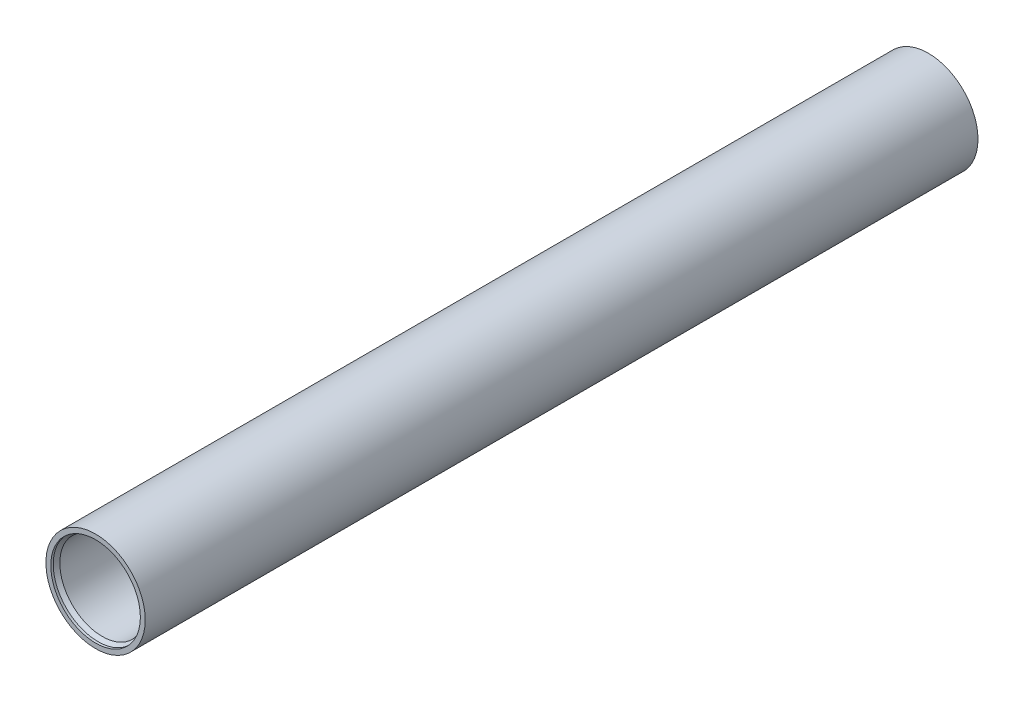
ISO-10303-21;
HEADER;
FILE_DESCRIPTION(('STEP AP214'),'2;1');
FILE_NAME('part.step','',(''),(''),'','','');
FILE_SCHEMA(('AUTOMOTIVE_DESIGN { 1 0 10303 214 1 1 1 1 }'));
ENDSEC;
DATA;
#1=APPLICATION_CONTEXT('core data for automotive mechanical design processes');
#2=APPLICATION_PROTOCOL_DEFINITION('international standard','automotive_design',2000,#1);
#3=PRODUCT_CONTEXT('',#1,'mechanical');
#4=PRODUCT('Part','Part','',(#3));
#5=PRODUCT_RELATED_PRODUCT_CATEGORY('part','',(#4));
#6=PRODUCT_DEFINITION_FORMATION('','',#4);
#7=PRODUCT_DEFINITION_CONTEXT('part definition',#1,'design');
#8=PRODUCT_DEFINITION('design','',#6,#7);
#9=PRODUCT_DEFINITION_SHAPE('','',#8);
#10=(LENGTH_UNIT() NAMED_UNIT(*) SI_UNIT(.MILLI.,.METRE.));
#11=(NAMED_UNIT(*) PLANE_ANGLE_UNIT() SI_UNIT($,.RADIAN.));
#12=(NAMED_UNIT(*) SI_UNIT($,.STERADIAN.) SOLID_ANGLE_UNIT());
#13=UNCERTAINTY_MEASURE_WITH_UNIT(LENGTH_MEASURE(1.E-05),#10,'distance_accuracy_value','');
#14=(GEOMETRIC_REPRESENTATION_CONTEXT(3) GLOBAL_UNCERTAINTY_ASSIGNED_CONTEXT((#13)) GLOBAL_UNIT_ASSIGNED_CONTEXT((#10,
#11,#12)) REPRESENTATION_CONTEXT('',''));
#15=CARTESIAN_POINT('',(0.,0.,0.));
#16=DIRECTION('',(0.,0.,1.));
#17=DIRECTION('',(1.,0.,0.));
#18=AXIS2_PLACEMENT_3D('',#15,#16,#17);
#19=CARTESIAN_POINT('',(0.,0.,260.460594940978));
#20=DIRECTION('',(0.,0.,1.));
#21=DIRECTION('',(1.,0.,0.));
#22=AXIS2_PLACEMENT_3D('',#19,#20,#21);
#23=CYLINDRICAL_SURFACE('',#22,20.6375);
#24=CARTESIAN_POINT('',(0.,0.,173.0375));
#25=DIRECTION('',(0.,0.,1.));
#26=DIRECTION('',(1.,0.,0.));
#27=AXIS2_PLACEMENT_3D('',#24,#25,#26);
#28=CIRCLE('',#27,20.6375);
#29=CARTESIAN_POINT('',(20.6375,0.,173.0375));
#30=VERTEX_POINT('',#29);
#31=EDGE_CURVE('E10',#30,#30,#28,.T.);
#32=ORIENTED_EDGE('',*,*,#31,.F.);
#33=EDGE_LOOP('',(#32));
#34=FACE_BOUND('',#33,.T.);
#35=CARTESIAN_POINT('',(0.,0.,-173.0375));
#36=DIRECTION('',(0.,0.,1.));
#37=DIRECTION('',(1.,0.,0.));
#38=AXIS2_PLACEMENT_3D('',#35,#36,#37);
#39=CIRCLE('',#38,20.6375);
#40=CARTESIAN_POINT('',(20.6375,0.,-173.0375));
#41=VERTEX_POINT('',#40);
#42=EDGE_CURVE('E93',#41,#41,#39,.T.);
#43=ORIENTED_EDGE('',*,*,#42,.T.);
#44=EDGE_LOOP('',(#43));
#45=FACE_BOUND('',#44,.T.);
#46=ADVANCED_FACE('F29',(#34,#45),#23,.T.);
#47=CARTESIAN_POINT('',(0.,20.6375,173.0375));
#48=DIRECTION('',(0.,0.,-1.));
#49=DIRECTION('',(-1.,0.,0.));
#50=AXIS2_PLACEMENT_3D('',#47,#48,#49);
#51=PLANE('',#50);
#52=CARTESIAN_POINT('',(0.,0.,173.0375));
#53=DIRECTION('',(0.,0.,1.));
#54=DIRECTION('',(1.,0.,0.));
#55=AXIS2_PLACEMENT_3D('',#52,#53,#54);
#56=CIRCLE('',#55,18.6182);
#57=CARTESIAN_POINT('',(18.6182,0.,173.0375));
#58=VERTEX_POINT('',#57);
#59=EDGE_CURVE('E35',#58,#58,#56,.T.);
#60=ORIENTED_EDGE('',*,*,#59,.F.);
#61=EDGE_LOOP('',(#60));
#62=FACE_BOUND('',#61,.T.);
#63=ORIENTED_EDGE('',*,*,#31,.T.);
#64=EDGE_LOOP('',(#63));
#65=FACE_BOUND('',#64,.T.);
#66=ADVANCED_FACE('F202',(#62,#65),#51,.F.);
#67=CARTESIAN_POINT('',(0.,0.,260.460594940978));
#68=DIRECTION('',(0.,0.,1.));
#69=DIRECTION('',(1.,0.,0.));
#70=AXIS2_PLACEMENT_3D('',#67,#68,#69);
#71=CYLINDRICAL_SURFACE('',#70,18.6182);
#72=CARTESIAN_POINT('',(0.,0.,172.0215));
#73=DIRECTION('',(0.,0.,1.));
#74=DIRECTION('',(1.,0.,0.));
#75=AXIS2_PLACEMENT_3D('',#72,#73,#74);
#76=CIRCLE('',#75,18.6182);
#77=CARTESIAN_POINT('',(18.6182,0.,172.0215));
#78=VERTEX_POINT('',#77);
#79=EDGE_CURVE('E39',#78,#78,#76,.T.);
#80=ORIENTED_EDGE('',*,*,#79,.F.);
#81=EDGE_LOOP('',(#80));
#82=FACE_BOUND('',#81,.T.);
#83=ORIENTED_EDGE('',*,*,#59,.T.);
#84=EDGE_LOOP('',(#83));
#85=FACE_BOUND('',#84,.T.);
#86=ADVANCED_FACE('F197',(#82,#85),#71,.F.);
#87=CARTESIAN_POINT('',(0.,0.,172.0215));
#88=DIRECTION('',(0.,0.,1.));
#89=DIRECTION('',(1.,0.,0.));
#90=AXIS2_PLACEMENT_3D('',#87,#88,#89);
#91=CONICAL_SURFACE('',#90,18.6182,0.523598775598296);
#92=CARTESIAN_POINT('',(0.,0.,170.283733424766));
#93=DIRECTION('',(0.,0.,1.));
#94=DIRECTION('',(1.,0.,0.));
#95=AXIS2_PLACEMENT_3D('',#92,#93,#94);
#96=CIRCLE('',#95,17.6149);
#97=CARTESIAN_POINT('',(17.6149,0.,170.283733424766));
#98=VERTEX_POINT('',#97);
#99=EDGE_CURVE('E43',#98,#98,#96,.T.);
#100=ORIENTED_EDGE('',*,*,#99,.F.);
#101=EDGE_LOOP('',(#100));
#102=FACE_BOUND('',#101,.T.);
#103=ORIENTED_EDGE('',*,*,#79,.T.);
#104=EDGE_LOOP('',(#103));
#105=FACE_BOUND('',#104,.T.);
#106=ADVANCED_FACE('F191',(#102,#105),#91,.F.);
#107=CARTESIAN_POINT('',(0.,0.,260.460594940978));
#108=DIRECTION('',(0.,0.,1.));
#109=DIRECTION('',(1.,0.,0.));
#110=AXIS2_PLACEMENT_3D('',#107,#108,#109);
#111=CYLINDRICAL_SURFACE('',#110,17.6149);
#112=CARTESIAN_POINT('',(0.,0.,142.875));
#113=DIRECTION('',(0.,0.,1.));
#114=DIRECTION('',(1.,0.,0.));
#115=AXIS2_PLACEMENT_3D('',#112,#113,#114);
#116=CIRCLE('',#115,17.6149);
#117=CARTESIAN_POINT('',(17.6149,0.,142.875));
#118=VERTEX_POINT('',#117);
#119=EDGE_CURVE('E48',#118,#118,#116,.T.);
#120=ORIENTED_EDGE('',*,*,#119,.F.);
#121=EDGE_LOOP('',(#120));
#122=FACE_BOUND('',#121,.T.);
#123=ORIENTED_EDGE('',*,*,#99,.T.);
#124=EDGE_LOOP('',(#123));
#125=FACE_BOUND('',#124,.T.);
#126=ADVANCED_FACE('F185',(#122,#125),#111,.F.);
#127=CARTESIAN_POINT('',(0.,17.6149,142.875));
#128=DIRECTION('',(0.,0.,1.));
#129=DIRECTION('',(1.,0.,0.));
#130=AXIS2_PLACEMENT_3D('',#127,#128,#129);
#131=PLANE('',#130);
#132=CARTESIAN_POINT('',(0.,0.,142.875));
#133=DIRECTION('',(0.,0.,1.));
#134=DIRECTION('',(1.,0.,0.));
#135=AXIS2_PLACEMENT_3D('',#132,#133,#134);
#136=CIRCLE('',#135,17.6276);
#137=CARTESIAN_POINT('',(17.6276,0.,142.875));
#138=VERTEX_POINT('',#137);
#139=EDGE_CURVE('E51',#138,#138,#136,.T.);
#140=ORIENTED_EDGE('',*,*,#139,.F.);
#141=EDGE_LOOP('',(#140));
#142=FACE_BOUND('',#141,.T.);
#143=ORIENTED_EDGE('',*,*,#119,.T.);
#144=EDGE_LOOP('',(#143));
#145=FACE_BOUND('',#144,.T.);
#146=ADVANCED_FACE('F179',(#142,#145),#131,.F.);
#147=CARTESIAN_POINT('',(0.,0.,260.460594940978));
#148=DIRECTION('',(0.,0.,1.));
#149=DIRECTION('',(1.,0.,0.));
#150=AXIS2_PLACEMENT_3D('',#147,#148,#149);
#151=CYLINDRICAL_SURFACE('',#150,17.6276);
#152=CARTESIAN_POINT('',(0.,0.,125.4125));
#153=DIRECTION('',(0.,0.,1.));
#154=DIRECTION('',(1.,0.,0.));
#155=AXIS2_PLACEMENT_3D('',#152,#153,#154);
#156=CIRCLE('',#155,17.6276);
#157=CARTESIAN_POINT('',(17.6276,0.,125.4125));
#158=VERTEX_POINT('',#157);
#159=EDGE_CURVE('E54',#158,#158,#156,.T.);
#160=ORIENTED_EDGE('',*,*,#159,.F.);
#161=EDGE_LOOP('',(#160));
#162=FACE_BOUND('',#161,.T.);
#163=ORIENTED_EDGE('',*,*,#139,.T.);
#164=EDGE_LOOP('',(#163));
#165=FACE_BOUND('',#164,.T.);
#166=ADVANCED_FACE('F173',(#162,#165),#151,.F.);
#167=CARTESIAN_POINT('',(0.,17.6276,125.4125));
#168=DIRECTION('',(0.,0.,-1.));
#169=DIRECTION('',(-1.,0.,0.));
#170=AXIS2_PLACEMENT_3D('',#167,#168,#169);
#171=PLANE('',#170);
#172=CARTESIAN_POINT('',(0.,0.,125.4125));
#173=DIRECTION('',(0.,0.,1.));
#174=DIRECTION('',(1.,0.,0.));
#175=AXIS2_PLACEMENT_3D('',#172,#173,#174);
#176=CIRCLE('',#175,17.4625);
#177=CARTESIAN_POINT('',(17.4625,0.,125.4125));
#178=VERTEX_POINT('',#177);
#179=EDGE_CURVE('E57',#178,#178,#176,.T.);
#180=ORIENTED_EDGE('',*,*,#179,.F.);
#181=EDGE_LOOP('',(#180));
#182=FACE_BOUND('',#181,.T.);
#183=ORIENTED_EDGE('',*,*,#159,.T.);
#184=EDGE_LOOP('',(#183));
#185=FACE_BOUND('',#184,.T.);
#186=ADVANCED_FACE('F167',(#182,#185),#171,.F.);
#187=CARTESIAN_POINT('',(0.,0.,260.460594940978));
#188=DIRECTION('',(0.,0.,1.));
#189=DIRECTION('',(1.,0.,0.));
#190=AXIS2_PLACEMENT_3D('',#187,#188,#189);
#191=CYLINDRICAL_SURFACE('',#190,17.4625);
#192=CARTESIAN_POINT('',(0.,0.,93.5355));
#193=DIRECTION('',(0.,0.,1.));
#194=DIRECTION('',(1.,0.,0.));
#195=AXIS2_PLACEMENT_3D('',#192,#193,#194);
#196=CIRCLE('',#195,17.4625);
#197=CARTESIAN_POINT('',(17.4625,0.,93.5355));
#198=VERTEX_POINT('',#197);
#199=EDGE_CURVE('E60',#198,#198,#196,.T.);
#200=ORIENTED_EDGE('',*,*,#199,.F.);
#201=EDGE_LOOP('',(#200));
#202=FACE_BOUND('',#201,.T.);
#203=ORIENTED_EDGE('',*,*,#179,.T.);
#204=EDGE_LOOP('',(#203));
#205=FACE_BOUND('',#204,.T.);
#206=ADVANCED_FACE('F161',(#202,#205),#191,.F.);
#207=CARTESIAN_POINT('',(0.,17.4625,93.5355));
#208=DIRECTION('',(0.,0.,-1.));
#209=DIRECTION('',(-1.,0.,0.));
#210=AXIS2_PLACEMENT_3D('',#207,#208,#209);
#211=PLANE('',#210);
#212=CARTESIAN_POINT('',(0.,0.,93.5355));
#213=DIRECTION('',(0.,0.,1.));
#214=DIRECTION('',(1.,0.,0.));
#215=AXIS2_PLACEMENT_3D('',#212,#213,#214);
#216=CIRCLE('',#215,16.2306);
#217=CARTESIAN_POINT('',(16.2306,0.,93.5355));
#218=VERTEX_POINT('',#217);
#219=EDGE_CURVE('E63',#218,#218,#216,.T.);
#220=ORIENTED_EDGE('',*,*,#219,.F.);
#221=EDGE_LOOP('',(#220));
#222=FACE_BOUND('',#221,.T.);
#223=ORIENTED_EDGE('',*,*,#199,.T.);
#224=EDGE_LOOP('',(#223));
#225=FACE_BOUND('',#224,.T.);
#226=ADVANCED_FACE('F155',(#222,#225),#211,.F.);
#227=CARTESIAN_POINT('',(0.,0.,260.460594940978));
#228=DIRECTION('',(0.,0.,1.));
#229=DIRECTION('',(1.,0.,0.));
#230=AXIS2_PLACEMENT_3D('',#227,#228,#229);
#231=CYLINDRICAL_SURFACE('',#230,16.2306);
#232=CARTESIAN_POINT('',(0.,0.,-4.64819999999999));
#233=DIRECTION('',(0.,0.,1.));
#234=DIRECTION('',(1.,0.,0.));
#235=AXIS2_PLACEMENT_3D('',#232,#233,#234);
#236=CIRCLE('',#235,16.2306);
#237=CARTESIAN_POINT('',(16.2306,0.,-4.64819999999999));
#238=VERTEX_POINT('',#237);
#239=EDGE_CURVE('E66',#238,#238,#236,.T.);
#240=ORIENTED_EDGE('',*,*,#239,.F.);
#241=EDGE_LOOP('',(#240));
#242=FACE_BOUND('',#241,.T.);
#243=ORIENTED_EDGE('',*,*,#219,.T.);
#244=EDGE_LOOP('',(#243));
#245=FACE_BOUND('',#244,.T.);
#246=ADVANCED_FACE('F149',(#242,#245),#231,.F.);
#247=CARTESIAN_POINT('',(0.,17.4625,-4.64819999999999));
#248=DIRECTION('',(0.,0.,1.));
#249=DIRECTION('',(1.,0.,0.));
#250=AXIS2_PLACEMENT_3D('',#247,#248,#249);
#251=PLANE('',#250);
#252=CARTESIAN_POINT('',(0.,0.,-4.64819999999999));
#253=DIRECTION('',(0.,0.,1.));
#254=DIRECTION('',(1.,0.,0.));
#255=AXIS2_PLACEMENT_3D('',#252,#253,#254);
#256=CIRCLE('',#255,17.4625);
#257=CARTESIAN_POINT('',(17.4625,0.,-4.64819999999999));
#258=VERTEX_POINT('',#257);
#259=EDGE_CURVE('E69',#258,#258,#256,.T.);
#260=ORIENTED_EDGE('',*,*,#259,.F.);
#261=EDGE_LOOP('',(#260));
#262=FACE_BOUND('',#261,.T.);
#263=ORIENTED_EDGE('',*,*,#239,.T.);
#264=EDGE_LOOP('',(#263));
#265=FACE_BOUND('',#264,.T.);
#266=ADVANCED_FACE('F143',(#262,#265),#251,.F.);
#267=CARTESIAN_POINT('',(0.,0.,260.460594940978));
#268=DIRECTION('',(0.,0.,1.));
#269=DIRECTION('',(1.,0.,0.));
#270=AXIS2_PLACEMENT_3D('',#267,#268,#269);
#271=CYLINDRICAL_SURFACE('',#270,17.4625);
#272=CARTESIAN_POINT('',(0.,0.,-19.05));
#273=DIRECTION('',(0.,0.,1.));
#274=DIRECTION('',(1.,0.,0.));
#275=AXIS2_PLACEMENT_3D('',#272,#273,#274);
#276=CIRCLE('',#275,17.4625);
#277=CARTESIAN_POINT('',(17.4625,0.,-19.05));
#278=VERTEX_POINT('',#277);
#279=EDGE_CURVE('E72',#278,#278,#276,.T.);
#280=ORIENTED_EDGE('',*,*,#279,.F.);
#281=EDGE_LOOP('',(#280));
#282=FACE_BOUND('',#281,.T.);
#283=ORIENTED_EDGE('',*,*,#259,.T.);
#284=EDGE_LOOP('',(#283));
#285=FACE_BOUND('',#284,.T.);
#286=ADVANCED_FACE('F137',(#282,#285),#271,.F.);
#287=CARTESIAN_POINT('',(0.,17.6276,-19.05));
#288=DIRECTION('',(0.,0.,1.));
#289=DIRECTION('',(1.,0.,0.));
#290=AXIS2_PLACEMENT_3D('',#287,#288,#289);
#291=PLANE('',#290);
#292=CARTESIAN_POINT('',(0.,0.,-19.05));
#293=DIRECTION('',(0.,0.,1.));
#294=DIRECTION('',(1.,0.,0.));
#295=AXIS2_PLACEMENT_3D('',#292,#293,#294);
#296=CIRCLE('',#295,17.6276);
#297=CARTESIAN_POINT('',(17.6276,0.,-19.05));
#298=VERTEX_POINT('',#297);
#299=EDGE_CURVE('E75',#298,#298,#296,.T.);
#300=ORIENTED_EDGE('',*,*,#299,.F.);
#301=EDGE_LOOP('',(#300));
#302=FACE_BOUND('',#301,.T.);
#303=ORIENTED_EDGE('',*,*,#279,.T.);
#304=EDGE_LOOP('',(#303));
#305=FACE_BOUND('',#304,.T.);
#306=ADVANCED_FACE('F131',(#302,#305),#291,.F.);
#307=CARTESIAN_POINT('',(0.,0.,260.460594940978));
#308=DIRECTION('',(0.,0.,1.));
#309=DIRECTION('',(1.,0.,0.));
#310=AXIS2_PLACEMENT_3D('',#307,#308,#309);
#311=CYLINDRICAL_SURFACE('',#310,17.6276);
#312=CARTESIAN_POINT('',(0.,0.,-106.3625));
#313=DIRECTION('',(0.,0.,1.));
#314=DIRECTION('',(1.,0.,0.));
#315=AXIS2_PLACEMENT_3D('',#312,#313,#314);
#316=CIRCLE('',#315,17.6276);
#317=CARTESIAN_POINT('',(17.6276,0.,-106.3625));
#318=VERTEX_POINT('',#317);
#319=EDGE_CURVE('E78',#318,#318,#316,.T.);
#320=ORIENTED_EDGE('',*,*,#319,.F.);
#321=EDGE_LOOP('',(#320));
#322=FACE_BOUND('',#321,.T.);
#323=ORIENTED_EDGE('',*,*,#299,.T.);
#324=EDGE_LOOP('',(#323));
#325=FACE_BOUND('',#324,.T.);
#326=ADVANCED_FACE('F125',(#322,#325),#311,.F.);
#327=CARTESIAN_POINT('',(0.,17.6149000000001,-106.3625));
#328=DIRECTION('',(0.,0.,-1.));
#329=DIRECTION('',(-1.,0.,0.));
#330=AXIS2_PLACEMENT_3D('',#327,#328,#329);
#331=PLANE('',#330);
#332=CARTESIAN_POINT('',(0.,0.,-106.3625));
#333=DIRECTION('',(0.,0.,1.));
#334=DIRECTION('',(1.,0.,0.));
#335=AXIS2_PLACEMENT_3D('',#332,#333,#334);
#336=CIRCLE('',#335,17.6149000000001);
#337=CARTESIAN_POINT('',(17.6149000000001,0.,-106.3625));
#338=VERTEX_POINT('',#337);
#339=EDGE_CURVE('E81',#338,#338,#336,.T.);
#340=ORIENTED_EDGE('',*,*,#339,.F.);
#341=EDGE_LOOP('',(#340));
#342=FACE_BOUND('',#341,.T.);
#343=ORIENTED_EDGE('',*,*,#319,.T.);
#344=EDGE_LOOP('',(#343));
#345=FACE_BOUND('',#344,.T.);
#346=ADVANCED_FACE('F119',(#342,#345),#331,.F.);
#347=CARTESIAN_POINT('',(0.,0.,260.460594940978));
#348=DIRECTION('',(0.,0.,1.));
#349=DIRECTION('',(1.,0.,0.));
#350=AXIS2_PLACEMENT_3D('',#347,#348,#349);
#351=CYLINDRICAL_SURFACE('',#350,17.6149000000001);
#352=CARTESIAN_POINT('',(0.,0.,-170.283733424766));
#353=DIRECTION('',(0.,0.,1.));
#354=DIRECTION('',(1.,0.,0.));
#355=AXIS2_PLACEMENT_3D('',#352,#353,#354);
#356=CIRCLE('',#355,17.6149000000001);
#357=CARTESIAN_POINT('',(17.6149000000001,0.,-170.283733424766));
#358=VERTEX_POINT('',#357);
#359=EDGE_CURVE('E84',#358,#358,#356,.T.);
#360=ORIENTED_EDGE('',*,*,#359,.F.);
#361=EDGE_LOOP('',(#360));
#362=FACE_BOUND('',#361,.T.);
#363=ORIENTED_EDGE('',*,*,#339,.T.);
#364=EDGE_LOOP('',(#363));
#365=FACE_BOUND('',#364,.T.);
#366=ADVANCED_FACE('F113',(#362,#365),#351,.F.);
#367=CARTESIAN_POINT('',(0.,0.,-170.283733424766));
#368=DIRECTION('',(0.,0.,-1.));
#369=DIRECTION('',(-1.,0.,0.));
#370=AXIS2_PLACEMENT_3D('',#367,#368,#369);
#371=CONICAL_SURFACE('',#370,17.6149000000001,0.523598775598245);
#372=CARTESIAN_POINT('',(0.,0.,-172.0215));
#373=DIRECTION('',(0.,0.,1.));
#374=DIRECTION('',(1.,0.,0.));
#375=AXIS2_PLACEMENT_3D('',#372,#373,#374);
#376=CIRCLE('',#375,18.6182);
#377=CARTESIAN_POINT('',(18.6182,0.,-172.0215));
#378=VERTEX_POINT('',#377);
#379=EDGE_CURVE('E87',#378,#378,#376,.T.);
#380=ORIENTED_EDGE('',*,*,#379,.F.);
#381=EDGE_LOOP('',(#380));
#382=FACE_BOUND('',#381,.T.);
#383=ORIENTED_EDGE('',*,*,#359,.T.);
#384=EDGE_LOOP('',(#383));
#385=FACE_BOUND('',#384,.T.);
#386=ADVANCED_FACE('F107',(#382,#385),#371,.F.);
#387=CARTESIAN_POINT('',(0.,0.,260.460594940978));
#388=DIRECTION('',(0.,0.,1.));
#389=DIRECTION('',(1.,0.,0.));
#390=AXIS2_PLACEMENT_3D('',#387,#388,#389);
#391=CYLINDRICAL_SURFACE('',#390,18.6182);
#392=CARTESIAN_POINT('',(0.,0.,-173.0375));
#393=DIRECTION('',(0.,0.,1.));
#394=DIRECTION('',(1.,0.,0.));
#395=AXIS2_PLACEMENT_3D('',#392,#393,#394);
#396=CIRCLE('',#395,18.6182);
#397=CARTESIAN_POINT('',(18.6182,0.,-173.0375));
#398=VERTEX_POINT('',#397);
#399=EDGE_CURVE('E90',#398,#398,#396,.T.);
#400=ORIENTED_EDGE('',*,*,#399,.F.);
#401=EDGE_LOOP('',(#400));
#402=FACE_BOUND('',#401,.T.);
#403=ORIENTED_EDGE('',*,*,#379,.T.);
#404=EDGE_LOOP('',(#403));
#405=FACE_BOUND('',#404,.T.);
#406=ADVANCED_FACE('F101',(#402,#405),#391,.F.);
#407=CARTESIAN_POINT('',(0.,20.6375,-173.0375));
#408=DIRECTION('',(0.,0.,1.));
#409=DIRECTION('',(1.,0.,0.));
#410=AXIS2_PLACEMENT_3D('',#407,#408,#409);
#411=PLANE('',#410);
#412=ORIENTED_EDGE('',*,*,#42,.F.);
#413=EDGE_LOOP('',(#412));
#414=FACE_BOUND('',#413,.T.);
#415=ORIENTED_EDGE('',*,*,#399,.T.);
#416=EDGE_LOOP('',(#415));
#417=FACE_BOUND('',#416,.T.);
#418=ADVANCED_FACE('F98',(#414,#417),#411,.F.);
#419=CLOSED_SHELL('',(#46,#66,#86,#106,#126,#146,#166,#186,#206,#226,#246,#266,#286,#306,#326,
#346,#366,#386,#406,#418));
#420=MANIFOLD_SOLID_BREP('B2',#419);
#421=ADVANCED_BREP_SHAPE_REPRESENTATION('',(#18,#420),#14);
#422=SHAPE_DEFINITION_REPRESENTATION(#9,#421);
ENDSEC;
END-ISO-10303-21;
